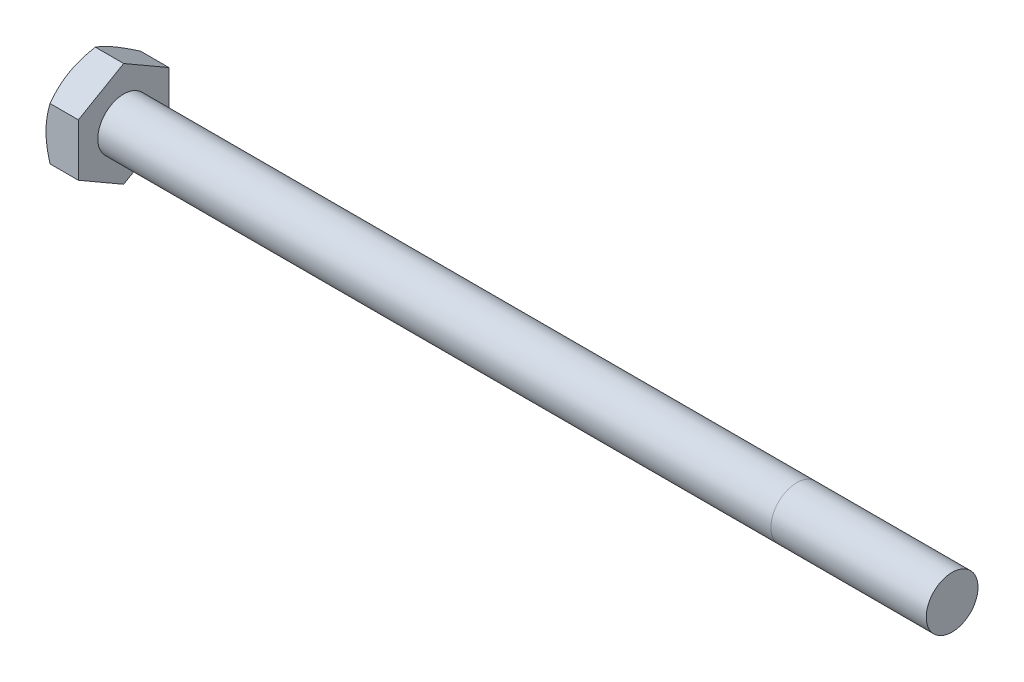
from build123d import *

# Parameters (mm, degrees)
SKETCH5_R           = 3.175
BOSS_EXTRUDE3_DEPTH = 101.6
BOSS_EXTRUDE4_DEPTH = 3.96875
SKETCH8_OUTSIDE_W   = 404.842
SKETCH8_OUTSIDE_H   = 406.562
SKETCH8_OUTSIDE_R   = 5.55625
CUT_EXTRUDE3_DEPTH  = 106.909373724
CUT_EXTRUDE3_DRAFT  = -60
CUT_EXTRUDE4_DEPTH  = 0.254
CIRPATTERN1_COUNT   = 3


with BuildPart() as part:
    # Sketch5 → Boss-Extrude3 (new body)
    with BuildSketch(Plane(origin=(52.784375, 0, 0), x_dir=(0, 0, -1), z_dir=(1, 0, 0))):
        Circle(SKETCH5_R)
    extrude(amount=-BOSS_EXTRUDE3_DEPTH)

    # Sketch11 → Revolve1 (revolve)
    with BuildSketch(Plane.XY):
        Polygon((-48.815625, 3.175), (-48.815625, 0), (36.909375, 0), (33.734375, 3.175), align=None)
    revolve(axis=Axis((-48.815625, 0, 0), (1, 0, 0)))

    # Sketch6 → Boss-Extrude4 (add)
    with BuildSketch(Plane.ZY.offset(48.815625)):
        Polygon((5.55625, 3.207902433), (0, 6.415804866), (-5.55625, 3.207902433), (-5.55625, -3.207902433), (0, -6.415804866), (5.55625, -3.207902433), align=None)
    extrude(amount=BOSS_EXTRUDE4_DEPTH)


with BuildPart() as cut_extrude3_tool:
    # Sketch8 outside → Cut-Extrude3 (with draft: the straight prism first)
    with BuildSketch(Plane.ZY.offset(52.784375)):
        Rectangle(SKETCH8_OUTSIDE_W, SKETCH8_OUTSIDE_H)
        Circle(SKETCH8_OUTSIDE_R, mode=Mode.SUBTRACT)
    extrude(amount=-CUT_EXTRUDE3_DEPTH)
    # Cut-Extrude3: the draft: its side faces are tilted about the plane it starts from
    cut_extrude3_sides = [cut_extrude3_tool.faces().sort_by_distance(p)[0] for p in [
        (0.670311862, -203.281, 0),
        (0.670311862, 0, 202.421),
        (0.670311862, 203.281, 0),
        (0.670311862, 0, -202.421),
        (0.670311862, 0, -5.55625),
    ]]
    draft(cut_extrude3_sides, Plane.ZY.offset(52.784375), CUT_EXTRUDE3_DRAFT)


with BuildPart() as part_1:
    add(part.part)

    # Cut-Extrude3: cut by cut_extrude3_tool
    add(cut_extrude3_tool.part, mode=Mode.SUBTRACT)

    # Sketch12 → Cut-Extrude4 (cut)
    with BuildSketch(Plane.ZY.offset(52.784375)):
        with BuildLine():
            Line((0.1666875, 4.2783125), (0.1666875, 2.3891875))
            ThreePointArc((0.1666875, 2.3891875), (0, 2.2225), (-0.1666875, 2.3891875))
            Line((-0.1666875, 2.3891875), (-0.1666875, 4.2783125))
            ThreePointArc((-0.1666875, 4.2783125), (0, 4.445), (0.1666875, 4.2783125))
        make_face()
    cut_extrude4 = extrude(amount=-CUT_EXTRUDE4_DEPTH, mode=Mode.SUBTRACT)

    # CirPattern1: Cut-Extrude4 ×3 about axis
    cirpattern1_axis = Axis((0, 0, 0), (1, 0, 0))
    for i in range(1, CIRPATTERN1_COUNT):
        add(cut_extrude4.rotate(cirpattern1_axis, i * 360 / CIRPATTERN1_COUNT), mode=Mode.SUBTRACT)


solid = part_1.part
